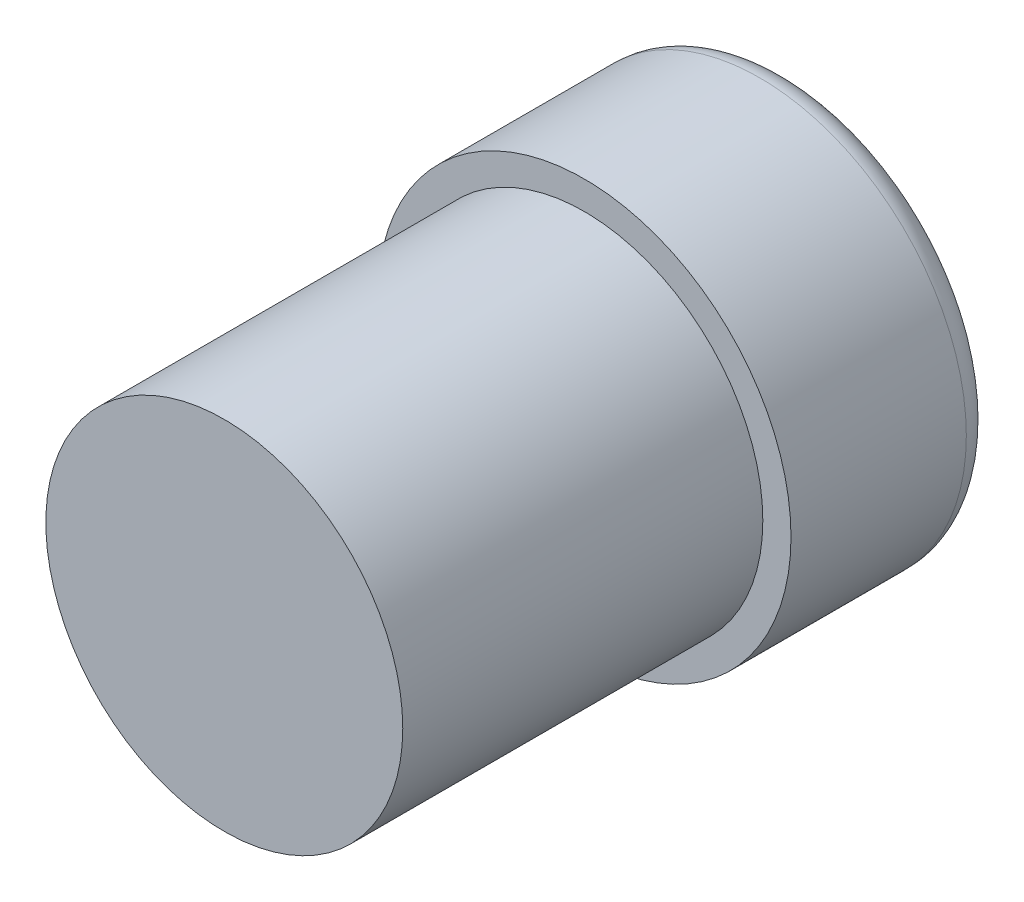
from build123d import *


with BuildPart() as part:
    # Sketch1 → Revolve1 (revolve)
    with BuildSketch(Plane(origin=(0, 0, 0), x_dir=(0, 0, -1), z_dir=(1, 0, 0)), mode=Mode.PRIVATE) as revolve1_sk:
        with BuildLine():
            Line((-15, 0), (15, 0))
            Line((15, 0), (15, 9.5))
            ThreePointArc((15, 9.5), (14.560660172, 10.560660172), (13.5, 11))
            Line((13.5, 11), (4.166666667, 11))
            Line((4.166666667, 11), (4.166666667, 9.5))
            Line((4.166666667, 9.5), (-15, 9.5))
            Line((-15, 9.5), (-15, 0))
        make_face()
    revolve(revolve1_sk.sketch.rotate(Axis((0, 0, 15), (0, 0, -1)), 90), axis=Axis((0, 0, 15), (0, 0, -1)))


solid = part.part
